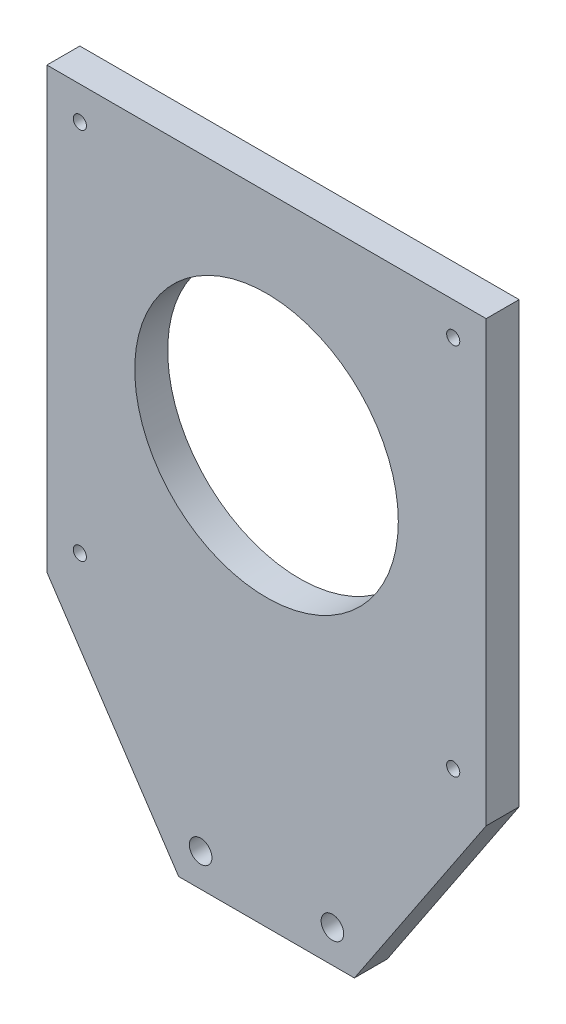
from build123d import *

# Parameters (mm, degrees)
BOSS_EXTRUDE1_DEPTH     = 9.525
SKETCH2_R               = 38.1
CUT_EXTRUDE1_DEPTH      = 137.672594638
F_1_4_CLEARANCE_HOLE1_D = 6.5278
F_6_CLEARANCE_HOLE1_D   = 3.7973


with BuildPart() as part:
    # Sketch1 → Boss-Extrude1 (new body)
    with BuildSketch(Plane.XY):
        Polygon((-63.5, 63.5), (63.5, 63.5), (63.5, -63.5), (25.4, -120.65), (-25.4, -120.65), (-63.5, -63.5), align=None)
    extrude(amount=BOSS_EXTRUDE1_DEPTH)

    # Sketch2 → Cut-Extrude1 (cut, through all)
    with BuildSketch(Plane.XY.offset(9.525)):
        Circle(SKETCH2_R)
    extrude(amount=-CUT_EXTRUDE1_DEPTH, mode=Mode.SUBTRACT)

    # 1_4 Clearance Hole1 (through all)
    with Locations(Plane.XY.offset(9.525)):
        with Locations((-19.05, -111.125), (19.05, -111.125)):
            Hole(F_1_4_CLEARANCE_HOLE1_D / 2)

    # 6 Clearance Hole1 (through all)
    with Locations(Plane.XY.offset(9.525)):
        with Locations((-53.975, 53.975), (53.975, 53.975), (53.975, -53.975), (-53.975, -53.975)):
            Hole(F_6_CLEARANCE_HOLE1_D / 2)


solid = part.part
